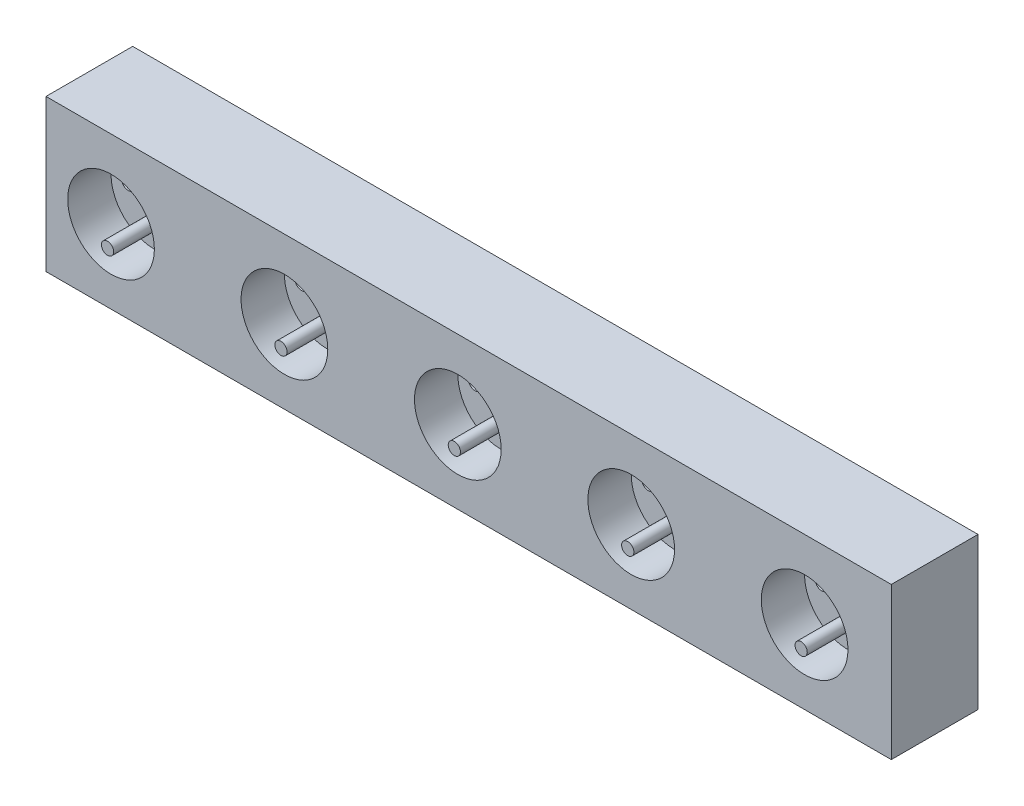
ISO-10303-21;
HEADER;
FILE_DESCRIPTION(('STEP AP214'),'2;1');
FILE_NAME('part.step','',(''),(''),'','','');
FILE_SCHEMA(('AUTOMOTIVE_DESIGN { 1 0 10303 214 1 1 1 1 }'));
ENDSEC;
DATA;
#1=APPLICATION_CONTEXT('core data for automotive mechanical design processes');
#2=APPLICATION_PROTOCOL_DEFINITION('international standard','automotive_design',2000,#1);
#3=PRODUCT_CONTEXT('',#1,'mechanical');
#4=PRODUCT('Part','Part','',(#3));
#5=PRODUCT_RELATED_PRODUCT_CATEGORY('part','',(#4));
#6=PRODUCT_DEFINITION_FORMATION('','',#4);
#7=PRODUCT_DEFINITION_CONTEXT('part definition',#1,'design');
#8=PRODUCT_DEFINITION('design','',#6,#7);
#9=PRODUCT_DEFINITION_SHAPE('','',#8);
#10=(LENGTH_UNIT() NAMED_UNIT(*) SI_UNIT(.MILLI.,.METRE.));
#11=(NAMED_UNIT(*) PLANE_ANGLE_UNIT() SI_UNIT($,.RADIAN.));
#12=(NAMED_UNIT(*) SI_UNIT($,.STERADIAN.) SOLID_ANGLE_UNIT());
#13=UNCERTAINTY_MEASURE_WITH_UNIT(LENGTH_MEASURE(1.E-05),#10,'distance_accuracy_value','');
#14=(GEOMETRIC_REPRESENTATION_CONTEXT(3) GLOBAL_UNCERTAINTY_ASSIGNED_CONTEXT((#13)) GLOBAL_UNIT_ASSIGNED_CONTEXT((#10,
#11,#12)) REPRESENTATION_CONTEXT('',''));
#15=CARTESIAN_POINT('',(0.,0.,0.));
#16=DIRECTION('',(0.,0.,1.));
#17=DIRECTION('',(1.,0.,0.));
#18=AXIS2_PLACEMENT_3D('',#15,#16,#17);
#19=CARTESIAN_POINT('',(350.,33.9456104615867,20.));
#20=DIRECTION('',(0.,0.,1.));
#21=DIRECTION('',(1.,0.,0.));
#22=AXIS2_PLACEMENT_3D('',#19,#20,#21);
#23=PLANE('',#22);
#24=CARTESIAN_POINT('',(350.,33.9456104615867,20.));
#25=DIRECTION('',(0.,0.,1.));
#26=DIRECTION('',(1.,0.,0.));
#27=AXIS2_PLACEMENT_3D('',#24,#25,#26);
#28=CIRCLE('',#27,20.);
#29=CARTESIAN_POINT('',(370.,33.9456104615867,20.));
#30=VERTEX_POINT('',#29);
#31=EDGE_CURVE('E148',#30,#30,#28,.T.);
#32=ORIENTED_EDGE('',*,*,#31,.T.);
#33=EDGE_LOOP('',(#32));
#34=FACE_BOUND('',#33,.T.);
#35=CARTESIAN_POINT('',(337.908834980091,34.3764797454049,20.));
#36=DIRECTION('',(0.,0.,1.));
#37=DIRECTION('',(1.,0.,0.));
#38=AXIS2_PLACEMENT_3D('',#35,#36,#37);
#39=CIRCLE('',#38,3.);
#40=CARTESIAN_POINT('',(340.908834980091,34.3764797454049,20.));
#41=VERTEX_POINT('',#40);
#42=EDGE_CURVE('E193',#41,#41,#39,.T.);
#43=ORIENTED_EDGE('',*,*,#42,.F.);
#44=EDGE_LOOP('',(#43));
#45=FACE_BOUND('',#44,.T.);
#46=CARTESIAN_POINT('',(361.668468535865,33.5996387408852,20.));
#47=DIRECTION('',(0.,0.,1.));
#48=DIRECTION('',(1.,0.,0.));
#49=AXIS2_PLACEMENT_3D('',#46,#47,#48);
#50=CIRCLE('',#49,3.);
#51=CARTESIAN_POINT('',(364.668468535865,33.5996387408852,20.));
#52=VERTEX_POINT('',#51);
#53=EDGE_CURVE('E199',#52,#52,#50,.T.);
#54=ORIENTED_EDGE('',*,*,#53,.F.);
#55=EDGE_LOOP('',(#54));
#56=FACE_BOUND('',#55,.T.);
#57=CARTESIAN_POINT('',(348.402569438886,23.5293401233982,20.));
#58=DIRECTION('',(0.,0.,1.));
#59=DIRECTION('',(1.,0.,0.));
#60=AXIS2_PLACEMENT_3D('',#57,#58,#59);
#61=CIRCLE('',#60,2.82416303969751);
#62=CARTESIAN_POINT('',(351.226732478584,23.5293401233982,20.));
#63=VERTEX_POINT('',#62);
#64=EDGE_CURVE('E223',#63,#63,#61,.T.);
#65=ORIENTED_EDGE('',*,*,#64,.F.);
#66=EDGE_LOOP('',(#65));
#67=FACE_BOUND('',#66,.T.);
#68=ADVANCED_FACE('F31',(#34,#45,#56,#67),#23,.T.);
#69=CARTESIAN_POINT('',(270.,33.9456104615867,20.));
#70=DIRECTION('',(0.,0.,1.));
#71=DIRECTION('',(1.,0.,0.));
#72=AXIS2_PLACEMENT_3D('',#69,#70,#71);
#73=PLANE('',#72);
#74=CARTESIAN_POINT('',(270.,33.9456104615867,20.));
#75=DIRECTION('',(0.,0.,1.));
#76=DIRECTION('',(1.,0.,0.));
#77=AXIS2_PLACEMENT_3D('',#74,#75,#76);
#78=CIRCLE('',#77,20.);
#79=CARTESIAN_POINT('',(290.,33.9456104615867,20.));
#80=VERTEX_POINT('',#79);
#81=EDGE_CURVE('E142',#80,#80,#78,.T.);
#82=ORIENTED_EDGE('',*,*,#81,.T.);
#83=EDGE_LOOP('',(#82));
#84=FACE_BOUND('',#83,.T.);
#85=CARTESIAN_POINT('',(257.908834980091,34.3764797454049,20.));
#86=DIRECTION('',(0.,0.,1.));
#87=DIRECTION('',(1.,0.,0.));
#88=AXIS2_PLACEMENT_3D('',#85,#86,#87);
#89=CIRCLE('',#88,3.);
#90=CARTESIAN_POINT('',(260.908834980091,34.3764797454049,20.));
#91=VERTEX_POINT('',#90);
#92=EDGE_CURVE('E181',#91,#91,#89,.T.);
#93=ORIENTED_EDGE('',*,*,#92,.F.);
#94=EDGE_LOOP('',(#93));
#95=FACE_BOUND('',#94,.T.);
#96=CARTESIAN_POINT('',(281.668468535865,33.5996387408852,20.));
#97=DIRECTION('',(0.,0.,1.));
#98=DIRECTION('',(1.,0.,0.));
#99=AXIS2_PLACEMENT_3D('',#96,#97,#98);
#100=CIRCLE('',#99,3.);
#101=CARTESIAN_POINT('',(284.668468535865,33.5996387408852,20.));
#102=VERTEX_POINT('',#101);
#103=EDGE_CURVE('E187',#102,#102,#100,.T.);
#104=ORIENTED_EDGE('',*,*,#103,.F.);
#105=EDGE_LOOP('',(#104));
#106=FACE_BOUND('',#105,.T.);
#107=CARTESIAN_POINT('',(268.402569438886,23.5293401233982,20.));
#108=DIRECTION('',(0.,0.,1.));
#109=DIRECTION('',(1.,0.,0.));
#110=AXIS2_PLACEMENT_3D('',#107,#108,#109);
#111=CIRCLE('',#110,2.82416303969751);
#112=CARTESIAN_POINT('',(271.226732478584,23.5293401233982,20.));
#113=VERTEX_POINT('',#112);
#114=EDGE_CURVE('E217',#113,#113,#111,.T.);
#115=ORIENTED_EDGE('',*,*,#114,.F.);
#116=EDGE_LOOP('',(#115));
#117=FACE_BOUND('',#116,.T.);
#118=ADVANCED_FACE('F239',(#84,#95,#106,#117),#73,.T.);
#119=CARTESIAN_POINT('',(190.,33.9456104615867,20.));
#120=DIRECTION('',(0.,0.,1.));
#121=DIRECTION('',(1.,0.,0.));
#122=AXIS2_PLACEMENT_3D('',#119,#120,#121);
#123=PLANE('',#122);
#124=CARTESIAN_POINT('',(190.,33.9456104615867,20.));
#125=DIRECTION('',(0.,0.,1.));
#126=DIRECTION('',(1.,0.,0.));
#127=AXIS2_PLACEMENT_3D('',#124,#125,#126);
#128=CIRCLE('',#127,20.);
#129=CARTESIAN_POINT('',(210.,33.9456104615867,20.));
#130=VERTEX_POINT('',#129);
#131=EDGE_CURVE('E136',#130,#130,#128,.T.);
#132=ORIENTED_EDGE('',*,*,#131,.T.);
#133=EDGE_LOOP('',(#132));
#134=FACE_BOUND('',#133,.T.);
#135=CARTESIAN_POINT('',(177.908834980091,34.3764797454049,20.));
#136=DIRECTION('',(0.,0.,1.));
#137=DIRECTION('',(1.,0.,0.));
#138=AXIS2_PLACEMENT_3D('',#135,#136,#137);
#139=CIRCLE('',#138,3.);
#140=CARTESIAN_POINT('',(180.908834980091,34.3764797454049,20.));
#141=VERTEX_POINT('',#140);
#142=EDGE_CURVE('E169',#141,#141,#139,.T.);
#143=ORIENTED_EDGE('',*,*,#142,.F.);
#144=EDGE_LOOP('',(#143));
#145=FACE_BOUND('',#144,.T.);
#146=CARTESIAN_POINT('',(201.668468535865,33.5996387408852,20.));
#147=DIRECTION('',(0.,0.,1.));
#148=DIRECTION('',(1.,0.,0.));
#149=AXIS2_PLACEMENT_3D('',#146,#147,#148);
#150=CIRCLE('',#149,3.);
#151=CARTESIAN_POINT('',(204.668468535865,33.5996387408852,20.));
#152=VERTEX_POINT('',#151);
#153=EDGE_CURVE('E175',#152,#152,#150,.T.);
#154=ORIENTED_EDGE('',*,*,#153,.F.);
#155=EDGE_LOOP('',(#154));
#156=FACE_BOUND('',#155,.T.);
#157=CARTESIAN_POINT('',(188.402569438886,23.5293401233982,20.));
#158=DIRECTION('',(0.,0.,1.));
#159=DIRECTION('',(1.,0.,0.));
#160=AXIS2_PLACEMENT_3D('',#157,#158,#159);
#161=CIRCLE('',#160,2.82416303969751);
#162=CARTESIAN_POINT('',(191.226732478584,23.5293401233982,20.));
#163=VERTEX_POINT('',#162);
#164=EDGE_CURVE('E211',#163,#163,#161,.T.);
#165=ORIENTED_EDGE('',*,*,#164,.F.);
#166=EDGE_LOOP('',(#165));
#167=FACE_BOUND('',#166,.T.);
#168=ADVANCED_FACE('F245',(#134,#145,#156,#167),#123,.T.);
#169=CARTESIAN_POINT('',(110.,33.9456104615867,20.));
#170=DIRECTION('',(0.,0.,1.));
#171=DIRECTION('',(1.,0.,0.));
#172=AXIS2_PLACEMENT_3D('',#169,#170,#171);
#173=PLANE('',#172);
#174=CARTESIAN_POINT('',(110.,33.9456104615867,20.));
#175=DIRECTION('',(0.,0.,1.));
#176=DIRECTION('',(1.,0.,0.));
#177=AXIS2_PLACEMENT_3D('',#174,#175,#176);
#178=CIRCLE('',#177,20.);
#179=CARTESIAN_POINT('',(130.,33.9456104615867,20.));
#180=VERTEX_POINT('',#179);
#181=EDGE_CURVE('E130',#180,#180,#178,.T.);
#182=ORIENTED_EDGE('',*,*,#181,.T.);
#183=EDGE_LOOP('',(#182));
#184=FACE_BOUND('',#183,.T.);
#185=CARTESIAN_POINT('',(97.9088349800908,34.3764797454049,20.));
#186=DIRECTION('',(0.,0.,1.));
#187=DIRECTION('',(1.,0.,0.));
#188=AXIS2_PLACEMENT_3D('',#185,#186,#187);
#189=CIRCLE('',#188,3.);
#190=CARTESIAN_POINT('',(100.908834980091,34.3764797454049,20.));
#191=VERTEX_POINT('',#190);
#192=EDGE_CURVE('E157',#191,#191,#189,.T.);
#193=ORIENTED_EDGE('',*,*,#192,.F.);
#194=EDGE_LOOP('',(#193));
#195=FACE_BOUND('',#194,.T.);
#196=CARTESIAN_POINT('',(121.668468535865,33.5996387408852,20.));
#197=DIRECTION('',(0.,0.,1.));
#198=DIRECTION('',(1.,0.,0.));
#199=AXIS2_PLACEMENT_3D('',#196,#197,#198);
#200=CIRCLE('',#199,3.);
#201=CARTESIAN_POINT('',(124.668468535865,33.5996387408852,20.));
#202=VERTEX_POINT('',#201);
#203=EDGE_CURVE('E163',#202,#202,#200,.T.);
#204=ORIENTED_EDGE('',*,*,#203,.F.);
#205=EDGE_LOOP('',(#204));
#206=FACE_BOUND('',#205,.T.);
#207=CARTESIAN_POINT('',(108.402569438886,23.5293401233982,20.));
#208=DIRECTION('',(0.,0.,1.));
#209=DIRECTION('',(1.,0.,0.));
#210=AXIS2_PLACEMENT_3D('',#207,#208,#209);
#211=CIRCLE('',#210,2.82416303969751);
#212=CARTESIAN_POINT('',(111.226732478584,23.5293401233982,20.));
#213=VERTEX_POINT('',#212);
#214=EDGE_CURVE('E205',#213,#213,#211,.T.);
#215=ORIENTED_EDGE('',*,*,#214,.F.);
#216=EDGE_LOOP('',(#215));
#217=FACE_BOUND('',#216,.T.);
#218=ADVANCED_FACE('F264',(#184,#195,#206,#217),#173,.T.);
#219=CARTESIAN_POINT('',(30.,33.9456104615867,20.));
#220=DIRECTION('',(0.,0.,1.));
#221=DIRECTION('',(1.,0.,0.));
#222=AXIS2_PLACEMENT_3D('',#219,#220,#221);
#223=PLANE('',#222);
#224=CARTESIAN_POINT('',(30.,33.9456104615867,20.));
#225=DIRECTION('',(0.,0.,1.));
#226=DIRECTION('',(1.,0.,0.));
#227=AXIS2_PLACEMENT_3D('',#224,#225,#226);
#228=CIRCLE('',#227,20.);
#229=CARTESIAN_POINT('',(50.,33.9456104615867,20.));
#230=VERTEX_POINT('',#229);
#231=EDGE_CURVE('E98',#230,#230,#228,.T.);
#232=ORIENTED_EDGE('',*,*,#231,.T.);
#233=EDGE_LOOP('',(#232));
#234=FACE_BOUND('',#233,.T.);
#235=CARTESIAN_POINT('',(17.9088349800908,34.3764797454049,20.));
#236=DIRECTION('',(0.,0.,1.));
#237=DIRECTION('',(1.,0.,0.));
#238=AXIS2_PLACEMENT_3D('',#235,#236,#237);
#239=CIRCLE('',#238,3.);
#240=CARTESIAN_POINT('',(20.9088349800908,34.3764797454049,20.));
#241=VERTEX_POINT('',#240);
#242=EDGE_CURVE('E115',#241,#241,#239,.T.);
#243=ORIENTED_EDGE('',*,*,#242,.F.);
#244=EDGE_LOOP('',(#243));
#245=FACE_BOUND('',#244,.T.);
#246=CARTESIAN_POINT('',(41.6684685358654,33.5996387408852,20.));
#247=DIRECTION('',(0.,0.,1.));
#248=DIRECTION('',(1.,0.,0.));
#249=AXIS2_PLACEMENT_3D('',#246,#247,#248);
#250=CIRCLE('',#249,3.);
#251=CARTESIAN_POINT('',(44.6684685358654,33.5996387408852,20.));
#252=VERTEX_POINT('',#251);
#253=EDGE_CURVE('E121',#252,#252,#250,.T.);
#254=ORIENTED_EDGE('',*,*,#253,.F.);
#255=EDGE_LOOP('',(#254));
#256=FACE_BOUND('',#255,.T.);
#257=CARTESIAN_POINT('',(28.4025694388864,23.5293401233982,20.));
#258=DIRECTION('',(0.,0.,1.));
#259=DIRECTION('',(1.,0.,0.));
#260=AXIS2_PLACEMENT_3D('',#257,#258,#259);
#261=CIRCLE('',#260,2.82416303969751);
#262=CARTESIAN_POINT('',(31.2267324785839,23.5293401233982,20.));
#263=VERTEX_POINT('',#262);
#264=EDGE_CURVE('E127',#263,#263,#261,.T.);
#265=ORIENTED_EDGE('',*,*,#264,.F.);
#266=EDGE_LOOP('',(#265));
#267=FACE_BOUND('',#266,.T.);
#268=ADVANCED_FACE('F272',(#234,#245,#256,#267),#223,.T.);
#269=CARTESIAN_POINT('',(0.,0.,40.));
#270=DIRECTION('',(1.,0.,0.));
#271=DIRECTION('',(0.,0.,-1.));
#272=AXIS2_PLACEMENT_3D('',#269,#270,#271);
#273=PLANE('',#272);
#274=DIRECTION('',(0.,-1.,0.));
#275=VECTOR('',#274,1.);
#276=CARTESIAN_POINT('',(0.,0.,0.));
#277=LINE('',#276,#275);
#278=CARTESIAN_POINT('',(0.,70.,0.));
#279=VERTEX_POINT('',#278);
#280=CARTESIAN_POINT('',(0.,0.,0.));
#281=VERTEX_POINT('',#280);
#282=EDGE_CURVE('E95',#279,#281,#277,.T.);
#283=ORIENTED_EDGE('',*,*,#282,.T.);
#284=DIRECTION('',(0.,0.,-1.));
#285=VECTOR('',#284,1.);
#286=CARTESIAN_POINT('',(0.,0.,40.));
#287=LINE('',#286,#285);
#288=CARTESIAN_POINT('',(0.,0.,40.));
#289=VERTEX_POINT('',#288);
#290=EDGE_CURVE('E11',#289,#281,#287,.T.);
#291=ORIENTED_EDGE('',*,*,#290,.F.);
#292=DIRECTION('',(0.,-1.,0.));
#293=VECTOR('',#292,1.);
#294=CARTESIAN_POINT('',(0.,0.,40.));
#295=LINE('',#294,#293);
#296=CARTESIAN_POINT('',(0.,70.,40.));
#297=VERTEX_POINT('',#296);
#298=EDGE_CURVE('E83',#297,#289,#295,.T.);
#299=ORIENTED_EDGE('',*,*,#298,.F.);
#300=DIRECTION('',(0.,0.,-1.));
#301=VECTOR('',#300,1.);
#302=CARTESIAN_POINT('',(0.,70.,40.));
#303=LINE('',#302,#301);
#304=EDGE_CURVE('E91',#297,#279,#303,.T.);
#305=ORIENTED_EDGE('',*,*,#304,.T.);
#306=EDGE_LOOP('',(#283,#291,#299,#305));
#307=FACE_BOUND('',#306,.T.);
#308=ADVANCED_FACE('F33',(#307),#273,.F.);
#309=CARTESIAN_POINT('',(0.,0.,40.));
#310=DIRECTION('',(0.,1.,0.));
#311=DIRECTION('',(0.,0.,1.));
#312=AXIS2_PLACEMENT_3D('',#309,#310,#311);
#313=PLANE('',#312);
#314=DIRECTION('',(1.,0.,0.));
#315=VECTOR('',#314,1.);
#316=CARTESIAN_POINT('',(0.,0.,0.));
#317=LINE('',#316,#315);
#318=CARTESIAN_POINT('',(390.,0.,0.));
#319=VERTEX_POINT('',#318);
#320=EDGE_CURVE('E87',#281,#319,#317,.T.);
#321=ORIENTED_EDGE('',*,*,#320,.T.);
#322=DIRECTION('',(0.,0.,-1.));
#323=VECTOR('',#322,1.);
#324=CARTESIAN_POINT('',(390.,0.,40.));
#325=LINE('',#324,#323);
#326=CARTESIAN_POINT('',(390.,0.,40.));
#327=VERTEX_POINT('',#326);
#328=EDGE_CURVE('E40',#327,#319,#325,.T.);
#329=ORIENTED_EDGE('',*,*,#328,.F.);
#330=DIRECTION('',(1.,0.,0.));
#331=VECTOR('',#330,1.);
#332=CARTESIAN_POINT('',(0.,0.,40.));
#333=LINE('',#332,#331);
#334=EDGE_CURVE('E78',#289,#327,#333,.T.);
#335=ORIENTED_EDGE('',*,*,#334,.F.);
#336=ORIENTED_EDGE('',*,*,#290,.T.);
#337=EDGE_LOOP('',(#321,#329,#335,#336));
#338=FACE_BOUND('',#337,.T.);
#339=ADVANCED_FACE('F86',(#338),#313,.F.);
#340=CARTESIAN_POINT('',(390.,0.,40.));
#341=DIRECTION('',(-1.,0.,0.));
#342=DIRECTION('',(0.,0.,1.));
#343=AXIS2_PLACEMENT_3D('',#340,#341,#342);
#344=PLANE('',#343);
#345=DIRECTION('',(0.,1.,0.));
#346=VECTOR('',#345,1.);
#347=CARTESIAN_POINT('',(390.,0.,0.));
#348=LINE('',#347,#346);
#349=CARTESIAN_POINT('',(390.,70.,0.));
#350=VERTEX_POINT('',#349);
#351=EDGE_CURVE('E65',#319,#350,#348,.T.);
#352=ORIENTED_EDGE('',*,*,#351,.T.);
#353=DIRECTION('',(0.,0.,-1.));
#354=VECTOR('',#353,1.);
#355=CARTESIAN_POINT('',(390.,70.,40.));
#356=LINE('',#355,#354);
#357=CARTESIAN_POINT('',(390.,70.,40.));
#358=VERTEX_POINT('',#357);
#359=EDGE_CURVE('E88',#358,#350,#356,.T.);
#360=ORIENTED_EDGE('',*,*,#359,.F.);
#361=DIRECTION('',(0.,1.,0.));
#362=VECTOR('',#361,1.);
#363=CARTESIAN_POINT('',(390.,0.,40.));
#364=LINE('',#363,#362);
#365=EDGE_CURVE('E81',#327,#358,#364,.T.);
#366=ORIENTED_EDGE('',*,*,#365,.F.);
#367=ORIENTED_EDGE('',*,*,#328,.T.);
#368=EDGE_LOOP('',(#352,#360,#366,#367));
#369=FACE_BOUND('',#368,.T.);
#370=ADVANCED_FACE('F89',(#369),#344,.F.);
#371=CARTESIAN_POINT('',(0.,70.,40.));
#372=DIRECTION('',(0.,-1.,0.));
#373=DIRECTION('',(0.,0.,-1.));
#374=AXIS2_PLACEMENT_3D('',#371,#372,#373);
#375=PLANE('',#374);
#376=DIRECTION('',(-1.,0.,0.));
#377=VECTOR('',#376,1.);
#378=CARTESIAN_POINT('',(0.,70.,0.));
#379=LINE('',#378,#377);
#380=EDGE_CURVE('E71',#350,#279,#379,.T.);
#381=ORIENTED_EDGE('',*,*,#380,.T.);
#382=ORIENTED_EDGE('',*,*,#304,.F.);
#383=DIRECTION('',(-1.,0.,0.));
#384=VECTOR('',#383,1.);
#385=CARTESIAN_POINT('',(0.,70.,40.));
#386=LINE('',#385,#384);
#387=EDGE_CURVE('E48',#358,#297,#386,.T.);
#388=ORIENTED_EDGE('',*,*,#387,.F.);
#389=ORIENTED_EDGE('',*,*,#359,.T.);
#390=EDGE_LOOP('',(#381,#382,#388,#389));
#391=FACE_BOUND('',#390,.T.);
#392=ADVANCED_FACE('F103',(#391),#375,.F.);
#393=CARTESIAN_POINT('',(0.,70.,40.));
#394=DIRECTION('',(0.,0.,-1.));
#395=DIRECTION('',(-1.,0.,0.));
#396=AXIS2_PLACEMENT_3D('',#393,#394,#395);
#397=PLANE('',#396);
#398=CARTESIAN_POINT('',(350.,33.9456104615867,40.));
#399=DIRECTION('',(0.,0.,1.));
#400=DIRECTION('',(1.,0.,0.));
#401=AXIS2_PLACEMENT_3D('',#398,#399,#400);
#402=CIRCLE('',#401,20.);
#403=CARTESIAN_POINT('',(370.,33.9456104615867,40.));
#404=VERTEX_POINT('',#403);
#405=EDGE_CURVE('E151',#404,#404,#402,.T.);
#406=ORIENTED_EDGE('',*,*,#405,.F.);
#407=EDGE_LOOP('',(#406));
#408=FACE_BOUND('',#407,.T.);
#409=CARTESIAN_POINT('',(270.,33.9456104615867,40.));
#410=DIRECTION('',(0.,0.,1.));
#411=DIRECTION('',(1.,0.,0.));
#412=AXIS2_PLACEMENT_3D('',#409,#410,#411);
#413=CIRCLE('',#412,20.);
#414=CARTESIAN_POINT('',(290.,33.9456104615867,40.));
#415=VERTEX_POINT('',#414);
#416=EDGE_CURVE('E145',#415,#415,#413,.T.);
#417=ORIENTED_EDGE('',*,*,#416,.F.);
#418=EDGE_LOOP('',(#417));
#419=FACE_BOUND('',#418,.T.);
#420=CARTESIAN_POINT('',(190.,33.9456104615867,40.));
#421=DIRECTION('',(0.,0.,1.));
#422=DIRECTION('',(1.,0.,0.));
#423=AXIS2_PLACEMENT_3D('',#420,#421,#422);
#424=CIRCLE('',#423,20.);
#425=CARTESIAN_POINT('',(210.,33.9456104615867,40.));
#426=VERTEX_POINT('',#425);
#427=EDGE_CURVE('E139',#426,#426,#424,.T.);
#428=ORIENTED_EDGE('',*,*,#427,.F.);
#429=EDGE_LOOP('',(#428));
#430=FACE_BOUND('',#429,.T.);
#431=CARTESIAN_POINT('',(110.,33.9456104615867,40.));
#432=DIRECTION('',(0.,0.,1.));
#433=DIRECTION('',(1.,0.,0.));
#434=AXIS2_PLACEMENT_3D('',#431,#432,#433);
#435=CIRCLE('',#434,20.);
#436=CARTESIAN_POINT('',(130.,33.9456104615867,40.));
#437=VERTEX_POINT('',#436);
#438=EDGE_CURVE('E133',#437,#437,#435,.T.);
#439=ORIENTED_EDGE('',*,*,#438,.F.);
#440=EDGE_LOOP('',(#439));
#441=FACE_BOUND('',#440,.T.);
#442=CARTESIAN_POINT('',(30.,33.9456104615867,40.));
#443=DIRECTION('',(0.,0.,1.));
#444=DIRECTION('',(1.,0.,0.));
#445=AXIS2_PLACEMENT_3D('',#442,#443,#444);
#446=CIRCLE('',#445,20.);
#447=CARTESIAN_POINT('',(50.,33.9456104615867,40.));
#448=VERTEX_POINT('',#447);
#449=EDGE_CURVE('E109',#448,#448,#446,.T.);
#450=ORIENTED_EDGE('',*,*,#449,.F.);
#451=EDGE_LOOP('',(#450));
#452=FACE_BOUND('',#451,.T.);
#453=ORIENTED_EDGE('',*,*,#298,.T.);
#454=ORIENTED_EDGE('',*,*,#334,.T.);
#455=ORIENTED_EDGE('',*,*,#365,.T.);
#456=ORIENTED_EDGE('',*,*,#387,.T.);
#457=EDGE_LOOP('',(#453,#454,#455,#456));
#458=FACE_BOUND('',#457,.T.);
#459=ADVANCED_FACE('F79',(#408,#419,#430,#441,#452,#458),#397,.F.);
#460=CARTESIAN_POINT('',(0.,70.,0.));
#461=DIRECTION('',(0.,0.,-1.));
#462=DIRECTION('',(-1.,0.,0.));
#463=AXIS2_PLACEMENT_3D('',#460,#461,#462);
#464=PLANE('',#463);
#465=ORIENTED_EDGE('',*,*,#282,.F.);
#466=ORIENTED_EDGE('',*,*,#380,.F.);
#467=ORIENTED_EDGE('',*,*,#351,.F.);
#468=ORIENTED_EDGE('',*,*,#320,.F.);
#469=EDGE_LOOP('',(#465,#466,#467,#468));
#470=FACE_BOUND('',#469,.T.);
#471=ADVANCED_FACE('F106',(#470),#464,.T.);
#472=CARTESIAN_POINT('',(30.,33.9456104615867,20.));
#473=DIRECTION('',(0.,0.,1.));
#474=DIRECTION('',(1.,0.,0.));
#475=AXIS2_PLACEMENT_3D('',#472,#473,#474);
#476=CYLINDRICAL_SURFACE('',#475,20.);
#477=ORIENTED_EDGE('',*,*,#231,.F.);
#478=EDGE_LOOP('',(#477));
#479=FACE_BOUND('',#478,.T.);
#480=ORIENTED_EDGE('',*,*,#449,.T.);
#481=EDGE_LOOP('',(#480));
#482=FACE_BOUND('',#481,.T.);
#483=ADVANCED_FACE('F300',(#479,#482),#476,.F.);
#484=CARTESIAN_POINT('',(17.9088349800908,34.3764797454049,10.));
#485=DIRECTION('',(0.,0.,1.));
#486=DIRECTION('',(1.,0.,0.));
#487=AXIS2_PLACEMENT_3D('',#484,#485,#486);
#488=CYLINDRICAL_SURFACE('',#487,3.);
#489=CARTESIAN_POINT('',(17.9088349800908,34.3764797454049,10.));
#490=DIRECTION('',(0.,0.,1.));
#491=DIRECTION('',(1.,0.,0.));
#492=AXIS2_PLACEMENT_3D('',#489,#490,#491);
#493=CIRCLE('',#492,3.);
#494=CARTESIAN_POINT('',(20.9088349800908,34.3764797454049,10.));
#495=VERTEX_POINT('',#494);
#496=EDGE_CURVE('E112',#495,#495,#493,.T.);
#497=ORIENTED_EDGE('',*,*,#496,.F.);
#498=EDGE_LOOP('',(#497));
#499=FACE_BOUND('',#498,.T.);
#500=ORIENTED_EDGE('',*,*,#242,.T.);
#501=EDGE_LOOP('',(#500));
#502=FACE_BOUND('',#501,.T.);
#503=ADVANCED_FACE('F296',(#499,#502),#488,.F.);
#504=CARTESIAN_POINT('',(17.9088349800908,34.3764797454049,10.));
#505=DIRECTION('',(0.,0.,1.));
#506=DIRECTION('',(1.,0.,0.));
#507=AXIS2_PLACEMENT_3D('',#504,#505,#506);
#508=PLANE('',#507);
#509=ORIENTED_EDGE('',*,*,#496,.T.);
#510=EDGE_LOOP('',(#509));
#511=FACE_BOUND('',#510,.T.);
#512=ADVANCED_FACE('F292',(#511),#508,.T.);
#513=CARTESIAN_POINT('',(41.6684685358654,33.5996387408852,10.));
#514=DIRECTION('',(0.,0.,1.));
#515=DIRECTION('',(1.,0.,0.));
#516=AXIS2_PLACEMENT_3D('',#513,#514,#515);
#517=CYLINDRICAL_SURFACE('',#516,3.);
#518=CARTESIAN_POINT('',(41.6684685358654,33.5996387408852,10.));
#519=DIRECTION('',(0.,0.,1.));
#520=DIRECTION('',(1.,0.,0.));
#521=AXIS2_PLACEMENT_3D('',#518,#519,#520);
#522=CIRCLE('',#521,3.);
#523=CARTESIAN_POINT('',(44.6684685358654,33.5996387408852,10.));
#524=VERTEX_POINT('',#523);
#525=EDGE_CURVE('E118',#524,#524,#522,.T.);
#526=ORIENTED_EDGE('',*,*,#525,.F.);
#527=EDGE_LOOP('',(#526));
#528=FACE_BOUND('',#527,.T.);
#529=ORIENTED_EDGE('',*,*,#253,.T.);
#530=EDGE_LOOP('',(#529));
#531=FACE_BOUND('',#530,.T.);
#532=ADVANCED_FACE('F288',(#528,#531),#517,.F.);
#533=CARTESIAN_POINT('',(41.6684685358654,33.5996387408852,10.));
#534=DIRECTION('',(0.,0.,1.));
#535=DIRECTION('',(1.,0.,0.));
#536=AXIS2_PLACEMENT_3D('',#533,#534,#535);
#537=PLANE('',#536);
#538=ORIENTED_EDGE('',*,*,#525,.T.);
#539=EDGE_LOOP('',(#538));
#540=FACE_BOUND('',#539,.T.);
#541=ADVANCED_FACE('F284',(#540),#537,.T.);
#542=CARTESIAN_POINT('',(28.4025694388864,23.5293401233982,40.));
#543=DIRECTION('',(0.,0.,-1.));
#544=DIRECTION('',(-1.,0.,0.));
#545=AXIS2_PLACEMENT_3D('',#542,#543,#544);
#546=CYLINDRICAL_SURFACE('',#545,2.82416303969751);
#547=CARTESIAN_POINT('',(28.4025694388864,23.5293401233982,40.));
#548=DIRECTION('',(0.,0.,1.));
#549=DIRECTION('',(1.,0.,0.));
#550=AXIS2_PLACEMENT_3D('',#547,#548,#549);
#551=CIRCLE('',#550,2.82416303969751);
#552=CARTESIAN_POINT('',(31.2267324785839,23.5293401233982,40.));
#553=VERTEX_POINT('',#552);
#554=EDGE_CURVE('E124',#553,#553,#551,.T.);
#555=ORIENTED_EDGE('',*,*,#554,.F.);
#556=EDGE_LOOP('',(#555));
#557=FACE_BOUND('',#556,.T.);
#558=ORIENTED_EDGE('',*,*,#264,.T.);
#559=EDGE_LOOP('',(#558));
#560=FACE_BOUND('',#559,.T.);
#561=ADVANCED_FACE('F280',(#557,#560),#546,.T.);
#562=CARTESIAN_POINT('',(28.4025694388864,23.5293401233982,40.));
#563=DIRECTION('',(0.,0.,1.));
#564=DIRECTION('',(1.,0.,0.));
#565=AXIS2_PLACEMENT_3D('',#562,#563,#564);
#566=PLANE('',#565);
#567=ORIENTED_EDGE('',*,*,#554,.T.);
#568=EDGE_LOOP('',(#567));
#569=FACE_BOUND('',#568,.T.);
#570=ADVANCED_FACE('F276',(#569),#566,.T.);
#571=CARTESIAN_POINT('',(110.,33.9456104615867,20.));
#572=DIRECTION('',(0.,0.,1.));
#573=DIRECTION('',(1.,0.,0.));
#574=AXIS2_PLACEMENT_3D('',#571,#572,#573);
#575=CYLINDRICAL_SURFACE('',#574,20.);
#576=ORIENTED_EDGE('',*,*,#181,.F.);
#577=EDGE_LOOP('',(#576));
#578=FACE_BOUND('',#577,.T.);
#579=ORIENTED_EDGE('',*,*,#438,.T.);
#580=EDGE_LOOP('',(#579));
#581=FACE_BOUND('',#580,.T.);
#582=ADVANCED_FACE('F268',(#578,#581),#575,.F.);
#583=CARTESIAN_POINT('',(190.,33.9456104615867,20.));
#584=DIRECTION('',(0.,0.,1.));
#585=DIRECTION('',(1.,0.,0.));
#586=AXIS2_PLACEMENT_3D('',#583,#584,#585);
#587=CYLINDRICAL_SURFACE('',#586,20.);
#588=ORIENTED_EDGE('',*,*,#131,.F.);
#589=EDGE_LOOP('',(#588));
#590=FACE_BOUND('',#589,.T.);
#591=ORIENTED_EDGE('',*,*,#427,.T.);
#592=EDGE_LOOP('',(#591));
#593=FACE_BOUND('',#592,.T.);
#594=ADVANCED_FACE('F260',(#590,#593),#587,.F.);
#595=CARTESIAN_POINT('',(270.,33.9456104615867,20.));
#596=DIRECTION('',(0.,0.,1.));
#597=DIRECTION('',(1.,0.,0.));
#598=AXIS2_PLACEMENT_3D('',#595,#596,#597);
#599=CYLINDRICAL_SURFACE('',#598,20.);
#600=ORIENTED_EDGE('',*,*,#81,.F.);
#601=EDGE_LOOP('',(#600));
#602=FACE_BOUND('',#601,.T.);
#603=ORIENTED_EDGE('',*,*,#416,.T.);
#604=EDGE_LOOP('',(#603));
#605=FACE_BOUND('',#604,.T.);
#606=ADVANCED_FACE('F255',(#602,#605),#599,.F.);
#607=CARTESIAN_POINT('',(350.,33.9456104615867,20.));
#608=DIRECTION('',(0.,0.,1.));
#609=DIRECTION('',(1.,0.,0.));
#610=AXIS2_PLACEMENT_3D('',#607,#608,#609);
#611=CYLINDRICAL_SURFACE('',#610,20.);
#612=ORIENTED_EDGE('',*,*,#31,.F.);
#613=EDGE_LOOP('',(#612));
#614=FACE_BOUND('',#613,.T.);
#615=ORIENTED_EDGE('',*,*,#405,.T.);
#616=EDGE_LOOP('',(#615));
#617=FACE_BOUND('',#616,.T.);
#618=ADVANCED_FACE('F253',(#614,#617),#611,.F.);
#619=CARTESIAN_POINT('',(97.9088349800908,34.3764797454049,10.));
#620=DIRECTION('',(0.,0.,1.));
#621=DIRECTION('',(1.,0.,0.));
#622=AXIS2_PLACEMENT_3D('',#619,#620,#621);
#623=CYLINDRICAL_SURFACE('',#622,3.);
#624=CARTESIAN_POINT('',(97.9088349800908,34.3764797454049,10.));
#625=DIRECTION('',(0.,0.,1.));
#626=DIRECTION('',(1.,0.,0.));
#627=AXIS2_PLACEMENT_3D('',#624,#625,#626);
#628=CIRCLE('',#627,3.);
#629=CARTESIAN_POINT('',(100.908834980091,34.3764797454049,10.));
#630=VERTEX_POINT('',#629);
#631=EDGE_CURVE('E154',#630,#630,#628,.T.);
#632=ORIENTED_EDGE('',*,*,#631,.F.);
#633=EDGE_LOOP('',(#632));
#634=FACE_BOUND('',#633,.T.);
#635=ORIENTED_EDGE('',*,*,#192,.T.);
#636=EDGE_LOOP('',(#635));
#637=FACE_BOUND('',#636,.T.);
#638=ADVANCED_FACE('F251',(#634,#637),#623,.F.);
#639=CARTESIAN_POINT('',(97.9088349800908,34.3764797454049,10.));
#640=DIRECTION('',(0.,0.,1.));
#641=DIRECTION('',(1.,0.,0.));
#642=AXIS2_PLACEMENT_3D('',#639,#640,#641);
#643=PLANE('',#642);
#644=ORIENTED_EDGE('',*,*,#631,.T.);
#645=EDGE_LOOP('',(#644));
#646=FACE_BOUND('',#645,.T.);
#647=ADVANCED_FACE('F450',(#646),#643,.T.);
#648=CARTESIAN_POINT('',(121.668468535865,33.5996387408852,10.));
#649=DIRECTION('',(0.,0.,1.));
#650=DIRECTION('',(1.,0.,0.));
#651=AXIS2_PLACEMENT_3D('',#648,#649,#650);
#652=CYLINDRICAL_SURFACE('',#651,3.);
#653=CARTESIAN_POINT('',(121.668468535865,33.5996387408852,10.));
#654=DIRECTION('',(0.,0.,1.));
#655=DIRECTION('',(1.,0.,0.));
#656=AXIS2_PLACEMENT_3D('',#653,#654,#655);
#657=CIRCLE('',#656,3.);
#658=CARTESIAN_POINT('',(124.668468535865,33.5996387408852,10.));
#659=VERTEX_POINT('',#658);
#660=EDGE_CURVE('E160',#659,#659,#657,.T.);
#661=ORIENTED_EDGE('',*,*,#660,.F.);
#662=EDGE_LOOP('',(#661));
#663=FACE_BOUND('',#662,.T.);
#664=ORIENTED_EDGE('',*,*,#203,.T.);
#665=EDGE_LOOP('',(#664));
#666=FACE_BOUND('',#665,.T.);
#667=ADVANCED_FACE('F459',(#663,#666),#652,.F.);
#668=CARTESIAN_POINT('',(121.668468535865,33.5996387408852,10.));
#669=DIRECTION('',(0.,0.,1.));
#670=DIRECTION('',(1.,0.,0.));
#671=AXIS2_PLACEMENT_3D('',#668,#669,#670);
#672=PLANE('',#671);
#673=ORIENTED_EDGE('',*,*,#660,.T.);
#674=EDGE_LOOP('',(#673));
#675=FACE_BOUND('',#674,.T.);
#676=ADVANCED_FACE('F468',(#675),#672,.T.);
#677=CARTESIAN_POINT('',(177.908834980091,34.3764797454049,10.));
#678=DIRECTION('',(0.,0.,1.));
#679=DIRECTION('',(1.,0.,0.));
#680=AXIS2_PLACEMENT_3D('',#677,#678,#679);
#681=CYLINDRICAL_SURFACE('',#680,3.);
#682=CARTESIAN_POINT('',(177.908834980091,34.3764797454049,10.));
#683=DIRECTION('',(0.,0.,1.));
#684=DIRECTION('',(1.,0.,0.));
#685=AXIS2_PLACEMENT_3D('',#682,#683,#684);
#686=CIRCLE('',#685,3.);
#687=CARTESIAN_POINT('',(180.908834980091,34.3764797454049,10.));
#688=VERTEX_POINT('',#687);
#689=EDGE_CURVE('E166',#688,#688,#686,.T.);
#690=ORIENTED_EDGE('',*,*,#689,.F.);
#691=EDGE_LOOP('',(#690));
#692=FACE_BOUND('',#691,.T.);
#693=ORIENTED_EDGE('',*,*,#142,.T.);
#694=EDGE_LOOP('',(#693));
#695=FACE_BOUND('',#694,.T.);
#696=ADVANCED_FACE('F478',(#692,#695),#681,.F.);
#697=CARTESIAN_POINT('',(177.908834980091,34.3764797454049,10.));
#698=DIRECTION('',(0.,0.,1.));
#699=DIRECTION('',(1.,0.,0.));
#700=AXIS2_PLACEMENT_3D('',#697,#698,#699);
#701=PLANE('',#700);
#702=ORIENTED_EDGE('',*,*,#689,.T.);
#703=EDGE_LOOP('',(#702));
#704=FACE_BOUND('',#703,.T.);
#705=ADVANCED_FACE('F488',(#704),#701,.T.);
#706=CARTESIAN_POINT('',(201.668468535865,33.5996387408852,10.));
#707=DIRECTION('',(0.,0.,1.));
#708=DIRECTION('',(1.,0.,0.));
#709=AXIS2_PLACEMENT_3D('',#706,#707,#708);
#710=CYLINDRICAL_SURFACE('',#709,3.);
#711=CARTESIAN_POINT('',(201.668468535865,33.5996387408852,10.));
#712=DIRECTION('',(0.,0.,1.));
#713=DIRECTION('',(1.,0.,0.));
#714=AXIS2_PLACEMENT_3D('',#711,#712,#713);
#715=CIRCLE('',#714,3.);
#716=CARTESIAN_POINT('',(204.668468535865,33.5996387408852,10.));
#717=VERTEX_POINT('',#716);
#718=EDGE_CURVE('E172',#717,#717,#715,.T.);
#719=ORIENTED_EDGE('',*,*,#718,.F.);
#720=EDGE_LOOP('',(#719));
#721=FACE_BOUND('',#720,.T.);
#722=ORIENTED_EDGE('',*,*,#153,.T.);
#723=EDGE_LOOP('',(#722));
#724=FACE_BOUND('',#723,.T.);
#725=ADVANCED_FACE('F498',(#721,#724),#710,.F.);
#726=CARTESIAN_POINT('',(201.668468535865,33.5996387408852,10.));
#727=DIRECTION('',(0.,0.,1.));
#728=DIRECTION('',(1.,0.,0.));
#729=AXIS2_PLACEMENT_3D('',#726,#727,#728);
#730=PLANE('',#729);
#731=ORIENTED_EDGE('',*,*,#718,.T.);
#732=EDGE_LOOP('',(#731));
#733=FACE_BOUND('',#732,.T.);
#734=ADVANCED_FACE('F508',(#733),#730,.T.);
#735=CARTESIAN_POINT('',(257.908834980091,34.3764797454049,10.));
#736=DIRECTION('',(0.,0.,1.));
#737=DIRECTION('',(1.,0.,0.));
#738=AXIS2_PLACEMENT_3D('',#735,#736,#737);
#739=CYLINDRICAL_SURFACE('',#738,3.);
#740=CARTESIAN_POINT('',(257.908834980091,34.3764797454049,10.));
#741=DIRECTION('',(0.,0.,1.));
#742=DIRECTION('',(1.,0.,0.));
#743=AXIS2_PLACEMENT_3D('',#740,#741,#742);
#744=CIRCLE('',#743,3.);
#745=CARTESIAN_POINT('',(260.908834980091,34.3764797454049,10.));
#746=VERTEX_POINT('',#745);
#747=EDGE_CURVE('E178',#746,#746,#744,.T.);
#748=ORIENTED_EDGE('',*,*,#747,.F.);
#749=EDGE_LOOP('',(#748));
#750=FACE_BOUND('',#749,.T.);
#751=ORIENTED_EDGE('',*,*,#92,.T.);
#752=EDGE_LOOP('',(#751));
#753=FACE_BOUND('',#752,.T.);
#754=ADVANCED_FACE('F518',(#750,#753),#739,.F.);
#755=CARTESIAN_POINT('',(257.908834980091,34.3764797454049,10.));
#756=DIRECTION('',(0.,0.,1.));
#757=DIRECTION('',(1.,0.,0.));
#758=AXIS2_PLACEMENT_3D('',#755,#756,#757);
#759=PLANE('',#758);
#760=ORIENTED_EDGE('',*,*,#747,.T.);
#761=EDGE_LOOP('',(#760));
#762=FACE_BOUND('',#761,.T.);
#763=ADVANCED_FACE('F528',(#762),#759,.T.);
#764=CARTESIAN_POINT('',(281.668468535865,33.5996387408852,10.));
#765=DIRECTION('',(0.,0.,1.));
#766=DIRECTION('',(1.,0.,0.));
#767=AXIS2_PLACEMENT_3D('',#764,#765,#766);
#768=CYLINDRICAL_SURFACE('',#767,3.);
#769=CARTESIAN_POINT('',(281.668468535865,33.5996387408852,10.));
#770=DIRECTION('',(0.,0.,1.));
#771=DIRECTION('',(1.,0.,0.));
#772=AXIS2_PLACEMENT_3D('',#769,#770,#771);
#773=CIRCLE('',#772,3.);
#774=CARTESIAN_POINT('',(284.668468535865,33.5996387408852,10.));
#775=VERTEX_POINT('',#774);
#776=EDGE_CURVE('E184',#775,#775,#773,.T.);
#777=ORIENTED_EDGE('',*,*,#776,.F.);
#778=EDGE_LOOP('',(#777));
#779=FACE_BOUND('',#778,.T.);
#780=ORIENTED_EDGE('',*,*,#103,.T.);
#781=EDGE_LOOP('',(#780));
#782=FACE_BOUND('',#781,.T.);
#783=ADVANCED_FACE('F538',(#779,#782),#768,.F.);
#784=CARTESIAN_POINT('',(281.668468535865,33.5996387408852,10.));
#785=DIRECTION('',(0.,0.,1.));
#786=DIRECTION('',(1.,0.,0.));
#787=AXIS2_PLACEMENT_3D('',#784,#785,#786);
#788=PLANE('',#787);
#789=ORIENTED_EDGE('',*,*,#776,.T.);
#790=EDGE_LOOP('',(#789));
#791=FACE_BOUND('',#790,.T.);
#792=ADVANCED_FACE('F548',(#791),#788,.T.);
#793=CARTESIAN_POINT('',(337.908834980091,34.3764797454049,10.));
#794=DIRECTION('',(0.,0.,1.));
#795=DIRECTION('',(1.,0.,0.));
#796=AXIS2_PLACEMENT_3D('',#793,#794,#795);
#797=CYLINDRICAL_SURFACE('',#796,3.);
#798=CARTESIAN_POINT('',(337.908834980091,34.3764797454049,10.));
#799=DIRECTION('',(0.,0.,1.));
#800=DIRECTION('',(1.,0.,0.));
#801=AXIS2_PLACEMENT_3D('',#798,#799,#800);
#802=CIRCLE('',#801,3.);
#803=CARTESIAN_POINT('',(340.908834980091,34.3764797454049,10.));
#804=VERTEX_POINT('',#803);
#805=EDGE_CURVE('E190',#804,#804,#802,.T.);
#806=ORIENTED_EDGE('',*,*,#805,.F.);
#807=EDGE_LOOP('',(#806));
#808=FACE_BOUND('',#807,.T.);
#809=ORIENTED_EDGE('',*,*,#42,.T.);
#810=EDGE_LOOP('',(#809));
#811=FACE_BOUND('',#810,.T.);
#812=ADVANCED_FACE('F558',(#808,#811),#797,.F.);
#813=CARTESIAN_POINT('',(337.908834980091,34.3764797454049,10.));
#814=DIRECTION('',(0.,0.,1.));
#815=DIRECTION('',(1.,0.,0.));
#816=AXIS2_PLACEMENT_3D('',#813,#814,#815);
#817=PLANE('',#816);
#818=ORIENTED_EDGE('',*,*,#805,.T.);
#819=EDGE_LOOP('',(#818));
#820=FACE_BOUND('',#819,.T.);
#821=ADVANCED_FACE('F568',(#820),#817,.T.);
#822=CARTESIAN_POINT('',(361.668468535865,33.5996387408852,10.));
#823=DIRECTION('',(0.,0.,1.));
#824=DIRECTION('',(1.,0.,0.));
#825=AXIS2_PLACEMENT_3D('',#822,#823,#824);
#826=CYLINDRICAL_SURFACE('',#825,3.);
#827=CARTESIAN_POINT('',(361.668468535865,33.5996387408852,10.));
#828=DIRECTION('',(0.,0.,1.));
#829=DIRECTION('',(1.,0.,0.));
#830=AXIS2_PLACEMENT_3D('',#827,#828,#829);
#831=CIRCLE('',#830,3.);
#832=CARTESIAN_POINT('',(364.668468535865,33.5996387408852,10.));
#833=VERTEX_POINT('',#832);
#834=EDGE_CURVE('E196',#833,#833,#831,.T.);
#835=ORIENTED_EDGE('',*,*,#834,.F.);
#836=EDGE_LOOP('',(#835));
#837=FACE_BOUND('',#836,.T.);
#838=ORIENTED_EDGE('',*,*,#53,.T.);
#839=EDGE_LOOP('',(#838));
#840=FACE_BOUND('',#839,.T.);
#841=ADVANCED_FACE('F578',(#837,#840),#826,.F.);
#842=CARTESIAN_POINT('',(361.668468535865,33.5996387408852,10.));
#843=DIRECTION('',(0.,0.,1.));
#844=DIRECTION('',(1.,0.,0.));
#845=AXIS2_PLACEMENT_3D('',#842,#843,#844);
#846=PLANE('',#845);
#847=ORIENTED_EDGE('',*,*,#834,.T.);
#848=EDGE_LOOP('',(#847));
#849=FACE_BOUND('',#848,.T.);
#850=ADVANCED_FACE('F588',(#849),#846,.T.);
#851=CARTESIAN_POINT('',(108.402569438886,23.5293401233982,40.));
#852=DIRECTION('',(0.,0.,-1.));
#853=DIRECTION('',(-1.,0.,0.));
#854=AXIS2_PLACEMENT_3D('',#851,#852,#853);
#855=CYLINDRICAL_SURFACE('',#854,2.82416303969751);
#856=CARTESIAN_POINT('',(108.402569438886,23.5293401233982,40.));
#857=DIRECTION('',(0.,0.,1.));
#858=DIRECTION('',(1.,0.,0.));
#859=AXIS2_PLACEMENT_3D('',#856,#857,#858);
#860=CIRCLE('',#859,2.82416303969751);
#861=CARTESIAN_POINT('',(111.226732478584,23.5293401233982,40.));
#862=VERTEX_POINT('',#861);
#863=EDGE_CURVE('E202',#862,#862,#860,.T.);
#864=ORIENTED_EDGE('',*,*,#863,.F.);
#865=EDGE_LOOP('',(#864));
#866=FACE_BOUND('',#865,.T.);
#867=ORIENTED_EDGE('',*,*,#214,.T.);
#868=EDGE_LOOP('',(#867));
#869=FACE_BOUND('',#868,.T.);
#870=ADVANCED_FACE('F598',(#866,#869),#855,.T.);
#871=CARTESIAN_POINT('',(108.402569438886,23.5293401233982,40.));
#872=DIRECTION('',(0.,0.,1.));
#873=DIRECTION('',(1.,0.,0.));
#874=AXIS2_PLACEMENT_3D('',#871,#872,#873);
#875=PLANE('',#874);
#876=ORIENTED_EDGE('',*,*,#863,.T.);
#877=EDGE_LOOP('',(#876));
#878=FACE_BOUND('',#877,.T.);
#879=ADVANCED_FACE('F607',(#878),#875,.T.);
#880=CARTESIAN_POINT('',(188.402569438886,23.5293401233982,40.));
#881=DIRECTION('',(0.,0.,-1.));
#882=DIRECTION('',(-1.,0.,0.));
#883=AXIS2_PLACEMENT_3D('',#880,#881,#882);
#884=CYLINDRICAL_SURFACE('',#883,2.82416303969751);
#885=CARTESIAN_POINT('',(188.402569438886,23.5293401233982,40.));
#886=DIRECTION('',(0.,0.,1.));
#887=DIRECTION('',(1.,0.,0.));
#888=AXIS2_PLACEMENT_3D('',#885,#886,#887);
#889=CIRCLE('',#888,2.82416303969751);
#890=CARTESIAN_POINT('',(191.226732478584,23.5293401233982,40.));
#891=VERTEX_POINT('',#890);
#892=EDGE_CURVE('E208',#891,#891,#889,.T.);
#893=ORIENTED_EDGE('',*,*,#892,.F.);
#894=EDGE_LOOP('',(#893));
#895=FACE_BOUND('',#894,.T.);
#896=ORIENTED_EDGE('',*,*,#164,.T.);
#897=EDGE_LOOP('',(#896));
#898=FACE_BOUND('',#897,.T.);
#899=ADVANCED_FACE('F617',(#895,#898),#884,.T.);
#900=CARTESIAN_POINT('',(188.402569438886,23.5293401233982,40.));
#901=DIRECTION('',(0.,0.,1.));
#902=DIRECTION('',(1.,0.,0.));
#903=AXIS2_PLACEMENT_3D('',#900,#901,#902);
#904=PLANE('',#903);
#905=ORIENTED_EDGE('',*,*,#892,.T.);
#906=EDGE_LOOP('',(#905));
#907=FACE_BOUND('',#906,.T.);
#908=ADVANCED_FACE('F627',(#907),#904,.T.);
#909=CARTESIAN_POINT('',(268.402569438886,23.5293401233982,40.));
#910=DIRECTION('',(0.,0.,-1.));
#911=DIRECTION('',(-1.,0.,0.));
#912=AXIS2_PLACEMENT_3D('',#909,#910,#911);
#913=CYLINDRICAL_SURFACE('',#912,2.82416303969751);
#914=CARTESIAN_POINT('',(268.402569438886,23.5293401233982,40.));
#915=DIRECTION('',(0.,0.,1.));
#916=DIRECTION('',(1.,0.,0.));
#917=AXIS2_PLACEMENT_3D('',#914,#915,#916);
#918=CIRCLE('',#917,2.82416303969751);
#919=CARTESIAN_POINT('',(271.226732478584,23.5293401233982,40.));
#920=VERTEX_POINT('',#919);
#921=EDGE_CURVE('E214',#920,#920,#918,.T.);
#922=ORIENTED_EDGE('',*,*,#921,.F.);
#923=EDGE_LOOP('',(#922));
#924=FACE_BOUND('',#923,.T.);
#925=ORIENTED_EDGE('',*,*,#114,.T.);
#926=EDGE_LOOP('',(#925));
#927=FACE_BOUND('',#926,.T.);
#928=ADVANCED_FACE('F637',(#924,#927),#913,.T.);
#929=CARTESIAN_POINT('',(268.402569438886,23.5293401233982,40.));
#930=DIRECTION('',(0.,0.,1.));
#931=DIRECTION('',(1.,0.,0.));
#932=AXIS2_PLACEMENT_3D('',#929,#930,#931);
#933=PLANE('',#932);
#934=ORIENTED_EDGE('',*,*,#921,.T.);
#935=EDGE_LOOP('',(#934));
#936=FACE_BOUND('',#935,.T.);
#937=ADVANCED_FACE('F234',(#936),#933,.T.);
#938=CARTESIAN_POINT('',(348.402569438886,23.5293401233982,40.));
#939=DIRECTION('',(0.,0.,-1.));
#940=DIRECTION('',(-1.,0.,0.));
#941=AXIS2_PLACEMENT_3D('',#938,#939,#940);
#942=CYLINDRICAL_SURFACE('',#941,2.82416303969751);
#943=CARTESIAN_POINT('',(348.402569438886,23.5293401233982,40.));
#944=DIRECTION('',(0.,0.,1.));
#945=DIRECTION('',(1.,0.,0.));
#946=AXIS2_PLACEMENT_3D('',#943,#944,#945);
#947=CIRCLE('',#946,2.82416303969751);
#948=CARTESIAN_POINT('',(351.226732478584,23.5293401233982,40.));
#949=VERTEX_POINT('',#948);
#950=EDGE_CURVE('E220',#949,#949,#947,.T.);
#951=ORIENTED_EDGE('',*,*,#950,.F.);
#952=EDGE_LOOP('',(#951));
#953=FACE_BOUND('',#952,.T.);
#954=ORIENTED_EDGE('',*,*,#64,.T.);
#955=EDGE_LOOP('',(#954));
#956=FACE_BOUND('',#955,.T.);
#957=ADVANCED_FACE('F231',(#953,#956),#942,.T.);
#958=CARTESIAN_POINT('',(348.402569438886,23.5293401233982,40.));
#959=DIRECTION('',(0.,0.,1.));
#960=DIRECTION('',(1.,0.,0.));
#961=AXIS2_PLACEMENT_3D('',#958,#959,#960);
#962=PLANE('',#961);
#963=ORIENTED_EDGE('',*,*,#950,.T.);
#964=EDGE_LOOP('',(#963));
#965=FACE_BOUND('',#964,.T.);
#966=ADVANCED_FACE('F229',(#965),#962,.T.);
#967=CLOSED_SHELL('',(#68,#118,#168,#218,#268,#308,#339,#370,#392,#459,#471,#483,#503,#512,#532,
#541,#561,#570,#582,#594,#606,#618,#638,#647,#667,#676,#696,#705,#725,#734,#754,#763,#783,#792,
#812,#821,#841,#850,#870,#879,#899,#908,#928,#937,#957,#966));
#968=MANIFOLD_SOLID_BREP('B2',#967);
#969=ADVANCED_BREP_SHAPE_REPRESENTATION('',(#18,#968),#14);
#970=SHAPE_DEFINITION_REPRESENTATION(#9,#969);
ENDSEC;
END-ISO-10303-21;
